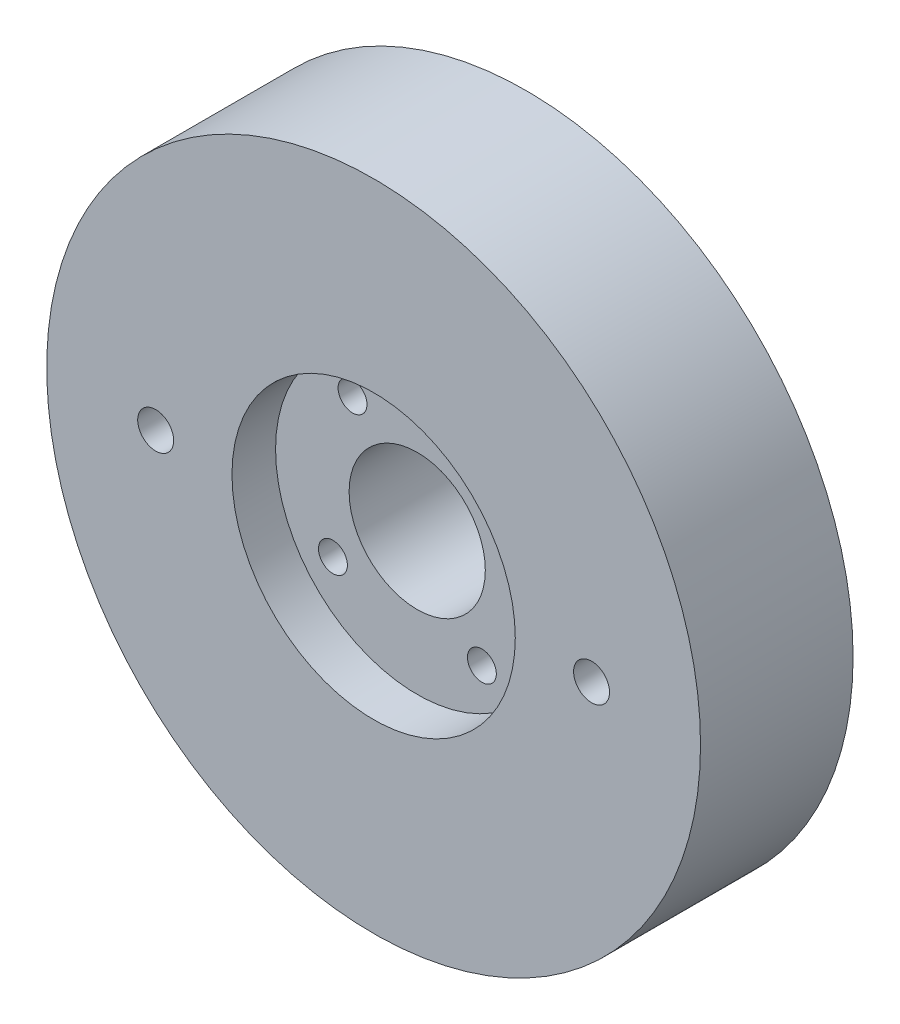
ISO-10303-21;
HEADER;
FILE_DESCRIPTION(('STEP AP214'),'2;1');
FILE_NAME('part.step','',(''),(''),'','','');
FILE_SCHEMA(('AUTOMOTIVE_DESIGN { 1 0 10303 214 1 1 1 1 }'));
ENDSEC;
DATA;
#1=APPLICATION_CONTEXT('core data for automotive mechanical design processes');
#2=APPLICATION_PROTOCOL_DEFINITION('international standard','automotive_design',2000,#1);
#3=PRODUCT_CONTEXT('',#1,'mechanical');
#4=PRODUCT('Part','Part','',(#3));
#5=PRODUCT_RELATED_PRODUCT_CATEGORY('part','',(#4));
#6=PRODUCT_DEFINITION_FORMATION('','',#4);
#7=PRODUCT_DEFINITION_CONTEXT('part definition',#1,'design');
#8=PRODUCT_DEFINITION('design','',#6,#7);
#9=PRODUCT_DEFINITION_SHAPE('','',#8);
#10=(LENGTH_UNIT() NAMED_UNIT(*) SI_UNIT(.MILLI.,.METRE.));
#11=(NAMED_UNIT(*) PLANE_ANGLE_UNIT() SI_UNIT($,.RADIAN.));
#12=(NAMED_UNIT(*) SI_UNIT($,.STERADIAN.) SOLID_ANGLE_UNIT());
#13=UNCERTAINTY_MEASURE_WITH_UNIT(LENGTH_MEASURE(1.E-05),#10,'distance_accuracy_value','');
#14=(GEOMETRIC_REPRESENTATION_CONTEXT(3) GLOBAL_UNCERTAINTY_ASSIGNED_CONTEXT((#13)) GLOBAL_UNIT_ASSIGNED_CONTEXT((#10,
#11,#12)) REPRESENTATION_CONTEXT('',''));
#15=CARTESIAN_POINT('',(0.,0.,0.));
#16=DIRECTION('',(0.,0.,1.));
#17=DIRECTION('',(1.,0.,0.));
#18=AXIS2_PLACEMENT_3D('',#15,#16,#17);
#19=CARTESIAN_POINT('',(-15.4703901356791,-11.87084786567,0.));
#20=DIRECTION('',(0.,0.,-1.));
#21=DIRECTION('',(-1.,0.,0.));
#22=AXIS2_PLACEMENT_3D('',#19,#20,#21);
#23=CYLINDRICAL_SURFACE('',#22,2.64999999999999);
#24=CARTESIAN_POINT('',(-15.4703901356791,-11.87084786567,20.));
#25=DIRECTION('',(0.,0.,1.));
#26=DIRECTION('',(1.,0.,0.));
#27=AXIS2_PLACEMENT_3D('',#24,#25,#26);
#28=CIRCLE('',#27,2.64999999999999);
#29=CARTESIAN_POINT('',(-12.8203901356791,-11.87084786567,20.));
#30=VERTEX_POINT('',#29);
#31=EDGE_CURVE('E101',#30,#30,#28,.T.);
#32=ORIENTED_EDGE('',*,*,#31,.T.);
#33=EDGE_LOOP('',(#32));
#34=FACE_BOUND('',#33,.T.);
#35=CARTESIAN_POINT('',(-15.4703901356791,-11.87084786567,7.5));
#36=DIRECTION('',(0.,0.,-1.));
#37=DIRECTION('',(-1.,0.,0.));
#38=AXIS2_PLACEMENT_3D('',#35,#36,#37);
#39=CIRCLE('',#38,2.64999999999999);
#40=CARTESIAN_POINT('',(-18.1203901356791,-11.87084786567,7.5));
#41=VERTEX_POINT('',#40);
#42=EDGE_CURVE('E124',#41,#41,#39,.F.);
#43=ORIENTED_EDGE('',*,*,#42,.F.);
#44=EDGE_LOOP('',(#43));
#45=FACE_BOUND('',#44,.T.);
#46=ADVANCED_FACE('F46',(#34,#45),#23,.F.);
#47=CARTESIAN_POINT('',(11.8708478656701,-15.4703901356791,0.));
#48=DIRECTION('',(0.,0.,-1.));
#49=DIRECTION('',(-1.,0.,0.));
#50=AXIS2_PLACEMENT_3D('',#47,#48,#49);
#51=CYLINDRICAL_SURFACE('',#50,2.64999999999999);
#52=CARTESIAN_POINT('',(11.8708478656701,-15.4703901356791,20.));
#53=DIRECTION('',(0.,0.,1.));
#54=DIRECTION('',(1.,0.,0.));
#55=AXIS2_PLACEMENT_3D('',#52,#53,#54);
#56=CIRCLE('',#55,2.64999999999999);
#57=CARTESIAN_POINT('',(14.5208478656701,-15.4703901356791,20.));
#58=VERTEX_POINT('',#57);
#59=EDGE_CURVE('E104',#58,#58,#56,.T.);
#60=ORIENTED_EDGE('',*,*,#59,.T.);
#61=EDGE_LOOP('',(#60));
#62=FACE_BOUND('',#61,.T.);
#63=CARTESIAN_POINT('',(11.8708478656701,-15.4703901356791,7.5));
#64=DIRECTION('',(0.,0.,-1.));
#65=DIRECTION('',(-1.,0.,0.));
#66=AXIS2_PLACEMENT_3D('',#63,#64,#65);
#67=CIRCLE('',#66,2.64999999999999);
#68=CARTESIAN_POINT('',(9.22084786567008,-15.4703901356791,7.5));
#69=VERTEX_POINT('',#68);
#70=EDGE_CURVE('E119',#69,#69,#67,.F.);
#71=ORIENTED_EDGE('',*,*,#70,.F.);
#72=EDGE_LOOP('',(#71));
#73=FACE_BOUND('',#72,.T.);
#74=ADVANCED_FACE('F143',(#62,#73),#51,.F.);
#75=CARTESIAN_POINT('',(-11.87084786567,15.4703901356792,0.));
#76=DIRECTION('',(0.,0.,-1.));
#77=DIRECTION('',(-1.,0.,0.));
#78=AXIS2_PLACEMENT_3D('',#75,#76,#77);
#79=CYLINDRICAL_SURFACE('',#78,2.64999999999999);
#80=CARTESIAN_POINT('',(-11.87084786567,15.4703901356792,20.));
#81=DIRECTION('',(0.,0.,1.));
#82=DIRECTION('',(1.,0.,0.));
#83=AXIS2_PLACEMENT_3D('',#80,#81,#82);
#84=CIRCLE('',#83,2.64999999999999);
#85=CARTESIAN_POINT('',(-9.22084786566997,15.4703901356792,20.));
#86=VERTEX_POINT('',#85);
#87=EDGE_CURVE('E98',#86,#86,#84,.T.);
#88=ORIENTED_EDGE('',*,*,#87,.T.);
#89=EDGE_LOOP('',(#88));
#90=FACE_BOUND('',#89,.T.);
#91=CARTESIAN_POINT('',(-11.87084786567,15.4703901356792,7.5));
#92=DIRECTION('',(0.,0.,-1.));
#93=DIRECTION('',(-1.,0.,0.));
#94=AXIS2_PLACEMENT_3D('',#91,#92,#93);
#95=CIRCLE('',#94,2.64999999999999);
#96=CARTESIAN_POINT('',(-14.5208478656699,15.4703901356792,7.5));
#97=VERTEX_POINT('',#96);
#98=EDGE_CURVE('E114',#97,#97,#95,.F.);
#99=ORIENTED_EDGE('',*,*,#98,.F.);
#100=EDGE_LOOP('',(#99));
#101=FACE_BOUND('',#100,.T.);
#102=ADVANCED_FACE('F149',(#90,#101),#79,.F.);
#103=CARTESIAN_POINT('',(15.470390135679,11.8708478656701,0.));
#104=DIRECTION('',(0.,0.,-1.));
#105=DIRECTION('',(-1.,0.,0.));
#106=AXIS2_PLACEMENT_3D('',#103,#104,#105);
#107=CYLINDRICAL_SURFACE('',#106,2.64999999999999);
#108=CARTESIAN_POINT('',(15.470390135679,11.8708478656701,20.));
#109=DIRECTION('',(0.,0.,1.));
#110=DIRECTION('',(1.,0.,0.));
#111=AXIS2_PLACEMENT_3D('',#108,#109,#110);
#112=CIRCLE('',#111,2.64999999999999);
#113=CARTESIAN_POINT('',(18.120390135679,11.8708478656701,20.));
#114=VERTEX_POINT('',#113);
#115=EDGE_CURVE('E107',#114,#114,#112,.T.);
#116=ORIENTED_EDGE('',*,*,#115,.T.);
#117=EDGE_LOOP('',(#116));
#118=FACE_BOUND('',#117,.T.);
#119=CARTESIAN_POINT('',(15.470390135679,11.8708478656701,7.5));
#120=DIRECTION('',(0.,0.,-1.));
#121=DIRECTION('',(-1.,0.,0.));
#122=AXIS2_PLACEMENT_3D('',#119,#120,#121);
#123=CIRCLE('',#122,2.64999999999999);
#124=CARTESIAN_POINT('',(12.820390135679,11.8708478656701,7.5));
#125=VERTEX_POINT('',#124);
#126=EDGE_CURVE('E110',#125,#125,#123,.F.);
#127=ORIENTED_EDGE('',*,*,#126,.F.);
#128=EDGE_LOOP('',(#127));
#129=FACE_BOUND('',#128,.T.);
#130=ADVANCED_FACE('F157',(#118,#129),#107,.F.);
#131=CARTESIAN_POINT('',(0.,0.,0.));
#132=DIRECTION('',(0.,0.,1.));
#133=DIRECTION('',(1.,0.,0.));
#134=AXIS2_PLACEMENT_3D('',#131,#132,#133);
#135=PLANE('',#134);
#136=CARTESIAN_POINT('',(-15.4703901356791,-11.87084786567,0.));
#137=DIRECTION('',(0.,0.,-1.));
#138=DIRECTION('',(-1.,0.,0.));
#139=AXIS2_PLACEMENT_3D('',#136,#137,#138);
#140=CIRCLE('',#139,5.);
#141=CARTESIAN_POINT('',(-20.4703901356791,-11.87084786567,0.));
#142=VERTEX_POINT('',#141);
#143=EDGE_CURVE('E425',#142,#142,#140,.T.);
#144=ORIENTED_EDGE('',*,*,#143,.F.);
#145=EDGE_LOOP('',(#144));
#146=FACE_BOUND('',#145,.T.);
#147=CARTESIAN_POINT('',(11.8708478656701,-15.4703901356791,0.));
#148=DIRECTION('',(0.,0.,-1.));
#149=DIRECTION('',(-1.,0.,0.));
#150=AXIS2_PLACEMENT_3D('',#147,#148,#149);
#151=CIRCLE('',#150,5.);
#152=CARTESIAN_POINT('',(6.87084786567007,-15.4703901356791,0.));
#153=VERTEX_POINT('',#152);
#154=EDGE_CURVE('E126',#153,#153,#151,.T.);
#155=ORIENTED_EDGE('',*,*,#154,.F.);
#156=EDGE_LOOP('',(#155));
#157=FACE_BOUND('',#156,.T.);
#158=CARTESIAN_POINT('',(-11.87084786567,15.4703901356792,0.));
#159=DIRECTION('',(0.,0.,-1.));
#160=DIRECTION('',(-1.,0.,0.));
#161=AXIS2_PLACEMENT_3D('',#158,#159,#160);
#162=CIRCLE('',#161,5.);
#163=CARTESIAN_POINT('',(-16.87084786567,15.4703901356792,0.));
#164=VERTEX_POINT('',#163);
#165=EDGE_CURVE('E122',#164,#164,#162,.T.);
#166=ORIENTED_EDGE('',*,*,#165,.F.);
#167=EDGE_LOOP('',(#166));
#168=FACE_BOUND('',#167,.T.);
#169=CARTESIAN_POINT('',(15.470390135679,11.8708478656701,0.));
#170=DIRECTION('',(0.,0.,-1.));
#171=DIRECTION('',(-1.,0.,0.));
#172=AXIS2_PLACEMENT_3D('',#169,#170,#171);
#173=CIRCLE('',#172,5.);
#174=CARTESIAN_POINT('',(10.470390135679,11.8708478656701,0.));
#175=VERTEX_POINT('',#174);
#176=EDGE_CURVE('E117',#175,#175,#173,.T.);
#177=ORIENTED_EDGE('',*,*,#176,.F.);
#178=EDGE_LOOP('',(#177));
#179=FACE_BOUND('',#178,.T.);
#180=CARTESIAN_POINT('',(0.,0.,0.));
#181=DIRECTION('',(0.,0.,1.));
#182=DIRECTION('',(1.,0.,0.));
#183=AXIS2_PLACEMENT_3D('',#180,#181,#182);
#184=CIRCLE('',#183,60.);
#185=CARTESIAN_POINT('',(60.,0.,0.));
#186=VERTEX_POINT('',#185);
#187=EDGE_CURVE('E90',#186,#186,#184,.T.);
#188=ORIENTED_EDGE('',*,*,#187,.F.);
#189=EDGE_LOOP('',(#188));
#190=FACE_BOUND('',#189,.T.);
#191=CARTESIAN_POINT('',(40.,0.,0.));
#192=DIRECTION('',(0.,0.,1.));
#193=DIRECTION('',(1.,0.,0.));
#194=AXIS2_PLACEMENT_3D('',#191,#192,#193);
#195=CIRCLE('',#194,3.29999999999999);
#196=CARTESIAN_POINT('',(43.3,0.,0.));
#197=VERTEX_POINT('',#196);
#198=EDGE_CURVE('E83',#197,#197,#195,.T.);
#199=ORIENTED_EDGE('',*,*,#198,.T.);
#200=EDGE_LOOP('',(#199));
#201=FACE_BOUND('',#200,.T.);
#202=CARTESIAN_POINT('',(-40.,0.,0.));
#203=DIRECTION('',(0.,0.,1.));
#204=DIRECTION('',(1.,0.,0.));
#205=AXIS2_PLACEMENT_3D('',#202,#203,#204);
#206=CIRCLE('',#205,3.29999999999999);
#207=CARTESIAN_POINT('',(-36.7,0.,0.));
#208=VERTEX_POINT('',#207);
#209=EDGE_CURVE('E70',#208,#208,#206,.T.);
#210=ORIENTED_EDGE('',*,*,#209,.T.);
#211=EDGE_LOOP('',(#210));
#212=FACE_BOUND('',#211,.T.);
#213=CARTESIAN_POINT('',(0.,0.,0.));
#214=DIRECTION('',(0.,0.,-1.));
#215=DIRECTION('',(-1.,0.,0.));
#216=AXIS2_PLACEMENT_3D('',#213,#214,#215);
#217=CIRCLE('',#216,12.5);
#218=CARTESIAN_POINT('',(-12.5,0.,0.));
#219=VERTEX_POINT('',#218);
#220=EDGE_CURVE('E73',#219,#219,#217,.T.);
#221=ORIENTED_EDGE('',*,*,#220,.F.);
#222=EDGE_LOOP('',(#221));
#223=FACE_BOUND('',#222,.T.);
#224=ADVANCED_FACE('F186',(#146,#157,#168,#179,#190,#201,#212,#223),#135,.F.);
#225=CARTESIAN_POINT('',(0.,0.,28.));
#226=DIRECTION('',(0.,0.,-1.));
#227=DIRECTION('',(-1.,0.,0.));
#228=AXIS2_PLACEMENT_3D('',#225,#226,#227);
#229=CYLINDRICAL_SURFACE('',#228,60.);
#230=CARTESIAN_POINT('',(0.,0.,28.));
#231=DIRECTION('',(0.,0.,1.));
#232=DIRECTION('',(1.,0.,0.));
#233=AXIS2_PLACEMENT_3D('',#230,#231,#232);
#234=CIRCLE('',#233,60.);
#235=CARTESIAN_POINT('',(60.,0.,28.));
#236=VERTEX_POINT('',#235);
#237=EDGE_CURVE('E93',#236,#236,#234,.T.);
#238=ORIENTED_EDGE('',*,*,#237,.F.);
#239=EDGE_LOOP('',(#238));
#240=FACE_BOUND('',#239,.T.);
#241=ORIENTED_EDGE('',*,*,#187,.T.);
#242=EDGE_LOOP('',(#241));
#243=FACE_BOUND('',#242,.T.);
#244=ADVANCED_FACE('F184',(#240,#243),#229,.T.);
#245=CARTESIAN_POINT('',(0.,0.,28.));
#246=DIRECTION('',(0.,0.,1.));
#247=DIRECTION('',(1.,0.,0.));
#248=AXIS2_PLACEMENT_3D('',#245,#246,#247);
#249=PLANE('',#248);
#250=CARTESIAN_POINT('',(-40.,0.,28.));
#251=DIRECTION('',(0.,0.,1.));
#252=DIRECTION('',(1.,0.,0.));
#253=AXIS2_PLACEMENT_3D('',#250,#251,#252);
#254=CIRCLE('',#253,3.29999999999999);
#255=CARTESIAN_POINT('',(-36.7,0.,28.));
#256=VERTEX_POINT('',#255);
#257=EDGE_CURVE('E66',#256,#256,#254,.T.);
#258=ORIENTED_EDGE('',*,*,#257,.F.);
#259=EDGE_LOOP('',(#258));
#260=FACE_BOUND('',#259,.T.);
#261=CARTESIAN_POINT('',(40.,0.,28.));
#262=DIRECTION('',(0.,0.,1.));
#263=DIRECTION('',(1.,0.,0.));
#264=AXIS2_PLACEMENT_3D('',#261,#262,#263);
#265=CIRCLE('',#264,3.29999999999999);
#266=CARTESIAN_POINT('',(43.3,0.,28.));
#267=VERTEX_POINT('',#266);
#268=EDGE_CURVE('E80',#267,#267,#265,.T.);
#269=ORIENTED_EDGE('',*,*,#268,.F.);
#270=EDGE_LOOP('',(#269));
#271=FACE_BOUND('',#270,.T.);
#272=CARTESIAN_POINT('',(0.,0.,28.));
#273=DIRECTION('',(0.,0.,1.));
#274=DIRECTION('',(1.,0.,0.));
#275=AXIS2_PLACEMENT_3D('',#272,#273,#274);
#276=CIRCLE('',#275,26.);
#277=CARTESIAN_POINT('',(26.,0.,28.));
#278=VERTEX_POINT('',#277);
#279=EDGE_CURVE('E86',#278,#278,#276,.T.);
#280=ORIENTED_EDGE('',*,*,#279,.F.);
#281=EDGE_LOOP('',(#280));
#282=FACE_BOUND('',#281,.T.);
#283=ORIENTED_EDGE('',*,*,#237,.T.);
#284=EDGE_LOOP('',(#283));
#285=FACE_BOUND('',#284,.T.);
#286=ADVANCED_FACE('F180',(#260,#271,#282,#285),#249,.T.);
#287=CARTESIAN_POINT('',(0.,0.,20.));
#288=DIRECTION('',(0.,0.,1.));
#289=DIRECTION('',(1.,0.,0.));
#290=AXIS2_PLACEMENT_3D('',#287,#288,#289);
#291=CYLINDRICAL_SURFACE('',#290,26.);
#292=CARTESIAN_POINT('',(0.,0.,20.));
#293=DIRECTION('',(0.,0.,1.));
#294=DIRECTION('',(1.,0.,0.));
#295=AXIS2_PLACEMENT_3D('',#292,#293,#294);
#296=CIRCLE('',#295,26.);
#297=CARTESIAN_POINT('',(26.,0.,20.));
#298=VERTEX_POINT('',#297);
#299=EDGE_CURVE('E87',#298,#298,#296,.T.);
#300=ORIENTED_EDGE('',*,*,#299,.F.);
#301=EDGE_LOOP('',(#300));
#302=FACE_BOUND('',#301,.T.);
#303=ORIENTED_EDGE('',*,*,#279,.T.);
#304=EDGE_LOOP('',(#303));
#305=FACE_BOUND('',#304,.T.);
#306=ADVANCED_FACE('F176',(#302,#305),#291,.F.);
#307=CARTESIAN_POINT('',(0.,0.,20.));
#308=DIRECTION('',(0.,0.,1.));
#309=DIRECTION('',(1.,0.,0.));
#310=AXIS2_PLACEMENT_3D('',#307,#308,#309);
#311=PLANE('',#310);
#312=CARTESIAN_POINT('',(19.5,0.,20.));
#313=DIRECTION('',(0.,0.,1.));
#314=DIRECTION('',(1.,0.,0.));
#315=AXIS2_PLACEMENT_3D('',#312,#313,#314);
#316=CIRCLE('',#315,2.50000000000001);
#317=CARTESIAN_POINT('',(22.,0.,20.));
#318=VERTEX_POINT('',#317);
#319=EDGE_CURVE('E13',#318,#318,#316,.F.);
#320=ORIENTED_EDGE('',*,*,#319,.T.);
#321=EDGE_LOOP('',(#320));
#322=FACE_BOUND('',#321,.T.);
#323=ORIENTED_EDGE('',*,*,#115,.F.);
#324=EDGE_LOOP('',(#323));
#325=FACE_BOUND('',#324,.T.);
#326=ORIENTED_EDGE('',*,*,#59,.F.);
#327=EDGE_LOOP('',(#326));
#328=FACE_BOUND('',#327,.T.);
#329=ORIENTED_EDGE('',*,*,#31,.F.);
#330=EDGE_LOOP('',(#329));
#331=FACE_BOUND('',#330,.T.);
#332=ORIENTED_EDGE('',*,*,#87,.F.);
#333=EDGE_LOOP('',(#332));
#334=FACE_BOUND('',#333,.T.);
#335=CARTESIAN_POINT('',(0.,0.,20.));
#336=DIRECTION('',(0.,0.,1.));
#337=DIRECTION('',(1.,0.,0.));
#338=AXIS2_PLACEMENT_3D('',#335,#336,#337);
#339=CIRCLE('',#338,12.5);
#340=CARTESIAN_POINT('',(12.5,0.,20.));
#341=VERTEX_POINT('',#340);
#342=EDGE_CURVE('E67',#341,#341,#339,.T.);
#343=ORIENTED_EDGE('',*,*,#342,.F.);
#344=EDGE_LOOP('',(#343));
#345=FACE_BOUND('',#344,.T.);
#346=ORIENTED_EDGE('',*,*,#299,.T.);
#347=EDGE_LOOP('',(#346));
#348=FACE_BOUND('',#347,.T.);
#349=ADVANCED_FACE('F172',(#322,#325,#328,#331,#334,#345,#348),#311,.T.);
#350=CARTESIAN_POINT('',(40.,0.,28.));
#351=DIRECTION('',(0.,0.,1.));
#352=DIRECTION('',(1.,0.,0.));
#353=AXIS2_PLACEMENT_3D('',#350,#351,#352);
#354=CYLINDRICAL_SURFACE('',#353,3.29999999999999);
#355=ORIENTED_EDGE('',*,*,#198,.F.);
#356=EDGE_LOOP('',(#355));
#357=FACE_BOUND('',#356,.T.);
#358=ORIENTED_EDGE('',*,*,#268,.T.);
#359=EDGE_LOOP('',(#358));
#360=FACE_BOUND('',#359,.T.);
#361=ADVANCED_FACE('F168',(#357,#360),#354,.F.);
#362=CARTESIAN_POINT('',(-40.,0.,28.));
#363=DIRECTION('',(0.,0.,1.));
#364=DIRECTION('',(1.,0.,0.));
#365=AXIS2_PLACEMENT_3D('',#362,#363,#364);
#366=CYLINDRICAL_SURFACE('',#365,3.29999999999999);
#367=ORIENTED_EDGE('',*,*,#209,.F.);
#368=EDGE_LOOP('',(#367));
#369=FACE_BOUND('',#368,.T.);
#370=ORIENTED_EDGE('',*,*,#257,.T.);
#371=EDGE_LOOP('',(#370));
#372=FACE_BOUND('',#371,.T.);
#373=ADVANCED_FACE('F60',(#369,#372),#366,.F.);
#374=CARTESIAN_POINT('',(19.5,0.,10.));
#375=DIRECTION('',(0.,0.,1.));
#376=DIRECTION('',(1.,0.,0.));
#377=AXIS2_PLACEMENT_3D('',#374,#375,#376);
#378=CONICAL_SURFACE('',#377,1.99999999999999,1.02974425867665);
#379=CARTESIAN_POINT('',(19.5,0.,8.79827876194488));
#380=VERTEX_POINT('',#379);
#381=VERTEX_LOOP('',#380);
#382=FACE_BOUND('',#381,.T.);
#383=CARTESIAN_POINT('',(19.5,0.,10.));
#384=DIRECTION('',(0.,0.,1.));
#385=DIRECTION('',(1.,0.,0.));
#386=AXIS2_PLACEMENT_3D('',#383,#384,#385);
#387=CIRCLE('',#386,1.99999999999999);
#388=CARTESIAN_POINT('',(21.5,0.,10.));
#389=VERTEX_POINT('',#388);
#390=EDGE_CURVE('E64',#389,#389,#387,.T.);
#391=ORIENTED_EDGE('',*,*,#390,.T.);
#392=EDGE_LOOP('',(#391));
#393=FACE_BOUND('',#392,.T.);
#394=ADVANCED_FACE('F56',(#382,#393),#378,.F.);
#395=CARTESIAN_POINT('',(19.5,0.,20.));
#396=DIRECTION('',(0.,0.,1.));
#397=DIRECTION('',(1.,0.,0.));
#398=AXIS2_PLACEMENT_3D('',#395,#396,#397);
#399=CYLINDRICAL_SURFACE('',#398,1.99999999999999);
#400=CARTESIAN_POINT('',(19.5,0.,19.5));
#401=DIRECTION('',(0.,0.,1.));
#402=DIRECTION('',(1.,0.,0.));
#403=AXIS2_PLACEMENT_3D('',#400,#401,#402);
#404=CIRCLE('',#403,1.99999999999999);
#405=CARTESIAN_POINT('',(21.5,0.,19.5));
#406=VERTEX_POINT('',#405);
#407=EDGE_CURVE('E53',#406,#406,#404,.T.);
#408=ORIENTED_EDGE('',*,*,#407,.T.);
#409=EDGE_LOOP('',(#408));
#410=FACE_BOUND('',#409,.T.);
#411=ORIENTED_EDGE('',*,*,#390,.F.);
#412=EDGE_LOOP('',(#411));
#413=FACE_BOUND('',#412,.T.);
#414=ADVANCED_FACE('F59',(#410,#413),#399,.F.);
#415=CARTESIAN_POINT('',(0.,0.,28.));
#416=DIRECTION('',(0.,0.,-1.));
#417=DIRECTION('',(-1.,0.,0.));
#418=AXIS2_PLACEMENT_3D('',#415,#416,#417);
#419=CYLINDRICAL_SURFACE('',#418,12.5);
#420=ORIENTED_EDGE('',*,*,#342,.T.);
#421=EDGE_LOOP('',(#420));
#422=FACE_BOUND('',#421,.T.);
#423=ORIENTED_EDGE('',*,*,#220,.T.);
#424=EDGE_LOOP('',(#423));
#425=FACE_BOUND('',#424,.T.);
#426=ADVANCED_FACE('F159',(#422,#425),#419,.F.);
#427=CARTESIAN_POINT('',(15.470390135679,11.8708478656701,7.5));
#428=DIRECTION('',(0.,0.,-1.));
#429=DIRECTION('',(-1.,0.,0.));
#430=AXIS2_PLACEMENT_3D('',#427,#428,#429);
#431=PLANE('',#430);
#432=CARTESIAN_POINT('',(15.470390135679,11.8708478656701,7.5));
#433=DIRECTION('',(0.,0.,-1.));
#434=DIRECTION('',(-1.,0.,0.));
#435=AXIS2_PLACEMENT_3D('',#432,#433,#434);
#436=CIRCLE('',#435,5.);
#437=CARTESIAN_POINT('',(10.470390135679,11.8708478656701,7.5));
#438=VERTEX_POINT('',#437);
#439=EDGE_CURVE('E113',#438,#438,#436,.T.);
#440=ORIENTED_EDGE('',*,*,#439,.T.);
#441=EDGE_LOOP('',(#440));
#442=FACE_BOUND('',#441,.T.);
#443=ORIENTED_EDGE('',*,*,#126,.T.);
#444=EDGE_LOOP('',(#443));
#445=FACE_BOUND('',#444,.T.);
#446=ADVANCED_FACE('F162',(#442,#445),#431,.T.);
#447=CARTESIAN_POINT('',(15.470390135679,11.8708478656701,7.5));
#448=DIRECTION('',(0.,0.,-1.));
#449=DIRECTION('',(-1.,0.,0.));
#450=AXIS2_PLACEMENT_3D('',#447,#448,#449);
#451=CYLINDRICAL_SURFACE('',#450,5.);
#452=ORIENTED_EDGE('',*,*,#439,.F.);
#453=EDGE_LOOP('',(#452));
#454=FACE_BOUND('',#453,.T.);
#455=ORIENTED_EDGE('',*,*,#176,.T.);
#456=EDGE_LOOP('',(#455));
#457=FACE_BOUND('',#456,.T.);
#458=ADVANCED_FACE('F257',(#454,#457),#451,.F.);
#459=CARTESIAN_POINT('',(-11.87084786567,15.4703901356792,7.5));
#460=DIRECTION('',(0.,0.,-1.));
#461=DIRECTION('',(-1.,0.,0.));
#462=AXIS2_PLACEMENT_3D('',#459,#460,#461);
#463=PLANE('',#462);
#464=CARTESIAN_POINT('',(-11.87084786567,15.4703901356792,7.5));
#465=DIRECTION('',(0.,0.,-1.));
#466=DIRECTION('',(-1.,0.,0.));
#467=AXIS2_PLACEMENT_3D('',#464,#465,#466);
#468=CIRCLE('',#467,5.);
#469=CARTESIAN_POINT('',(-16.87084786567,15.4703901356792,7.5));
#470=VERTEX_POINT('',#469);
#471=EDGE_CURVE('E118',#470,#470,#468,.T.);
#472=ORIENTED_EDGE('',*,*,#471,.T.);
#473=EDGE_LOOP('',(#472));
#474=FACE_BOUND('',#473,.T.);
#475=ORIENTED_EDGE('',*,*,#98,.T.);
#476=EDGE_LOOP('',(#475));
#477=FACE_BOUND('',#476,.T.);
#478=ADVANCED_FACE('F266',(#474,#477),#463,.T.);
#479=CARTESIAN_POINT('',(-11.87084786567,15.4703901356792,7.5));
#480=DIRECTION('',(0.,0.,-1.));
#481=DIRECTION('',(-1.,0.,0.));
#482=AXIS2_PLACEMENT_3D('',#479,#480,#481);
#483=CYLINDRICAL_SURFACE('',#482,5.);
#484=ORIENTED_EDGE('',*,*,#471,.F.);
#485=EDGE_LOOP('',(#484));
#486=FACE_BOUND('',#485,.T.);
#487=ORIENTED_EDGE('',*,*,#165,.T.);
#488=EDGE_LOOP('',(#487));
#489=FACE_BOUND('',#488,.T.);
#490=ADVANCED_FACE('F274',(#486,#489),#483,.F.);
#491=CARTESIAN_POINT('',(11.8708478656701,-15.4703901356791,7.5));
#492=DIRECTION('',(0.,0.,-1.));
#493=DIRECTION('',(-1.,0.,0.));
#494=AXIS2_PLACEMENT_3D('',#491,#492,#493);
#495=PLANE('',#494);
#496=CARTESIAN_POINT('',(11.8708478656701,-15.4703901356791,7.5));
#497=DIRECTION('',(0.,0.,-1.));
#498=DIRECTION('',(-1.,0.,0.));
#499=AXIS2_PLACEMENT_3D('',#496,#497,#498);
#500=CIRCLE('',#499,5.);
#501=CARTESIAN_POINT('',(6.87084786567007,-15.4703901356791,7.5));
#502=VERTEX_POINT('',#501);
#503=EDGE_CURVE('E123',#502,#502,#500,.T.);
#504=ORIENTED_EDGE('',*,*,#503,.T.);
#505=EDGE_LOOP('',(#504));
#506=FACE_BOUND('',#505,.T.);
#507=ORIENTED_EDGE('',*,*,#70,.T.);
#508=EDGE_LOOP('',(#507));
#509=FACE_BOUND('',#508,.T.);
#510=ADVANCED_FACE('F282',(#506,#509),#495,.T.);
#511=CARTESIAN_POINT('',(11.8708478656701,-15.4703901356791,7.5));
#512=DIRECTION('',(0.,0.,-1.));
#513=DIRECTION('',(-1.,0.,0.));
#514=AXIS2_PLACEMENT_3D('',#511,#512,#513);
#515=CYLINDRICAL_SURFACE('',#514,5.);
#516=ORIENTED_EDGE('',*,*,#503,.F.);
#517=EDGE_LOOP('',(#516));
#518=FACE_BOUND('',#517,.T.);
#519=ORIENTED_EDGE('',*,*,#154,.T.);
#520=EDGE_LOOP('',(#519));
#521=FACE_BOUND('',#520,.T.);
#522=ADVANCED_FACE('F290',(#518,#521),#515,.F.);
#523=CARTESIAN_POINT('',(-15.4703901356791,-11.87084786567,7.5));
#524=DIRECTION('',(0.,0.,-1.));
#525=DIRECTION('',(-1.,0.,0.));
#526=AXIS2_PLACEMENT_3D('',#523,#524,#525);
#527=PLANE('',#526);
#528=CARTESIAN_POINT('',(-15.4703901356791,-11.87084786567,7.5));
#529=DIRECTION('',(0.,0.,-1.));
#530=DIRECTION('',(-1.,0.,0.));
#531=AXIS2_PLACEMENT_3D('',#528,#529,#530);
#532=CIRCLE('',#531,5.);
#533=CARTESIAN_POINT('',(-20.4703901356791,-11.87084786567,7.5));
#534=VERTEX_POINT('',#533);
#535=EDGE_CURVE('E127',#534,#534,#532,.T.);
#536=ORIENTED_EDGE('',*,*,#535,.T.);
#537=EDGE_LOOP('',(#536));
#538=FACE_BOUND('',#537,.T.);
#539=ORIENTED_EDGE('',*,*,#42,.T.);
#540=EDGE_LOOP('',(#539));
#541=FACE_BOUND('',#540,.T.);
#542=ADVANCED_FACE('F138',(#538,#541),#527,.T.);
#543=CARTESIAN_POINT('',(-15.4703901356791,-11.87084786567,7.5));
#544=DIRECTION('',(0.,0.,-1.));
#545=DIRECTION('',(-1.,0.,0.));
#546=AXIS2_PLACEMENT_3D('',#543,#544,#545);
#547=CYLINDRICAL_SURFACE('',#546,5.);
#548=ORIENTED_EDGE('',*,*,#535,.F.);
#549=EDGE_LOOP('',(#548));
#550=FACE_BOUND('',#549,.T.);
#551=ORIENTED_EDGE('',*,*,#143,.T.);
#552=EDGE_LOOP('',(#551));
#553=FACE_BOUND('',#552,.T.);
#554=ADVANCED_FACE('F133',(#550,#553),#547,.F.);
#555=CARTESIAN_POINT('',(19.5,0.,19.5));
#556=DIRECTION('',(0.,0.,1.));
#557=DIRECTION('',(1.,0.,0.));
#558=AXIS2_PLACEMENT_3D('',#555,#556,#557);
#559=CONICAL_SURFACE('',#558,1.99999999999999,0.78539816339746);
#560=ORIENTED_EDGE('',*,*,#319,.F.);
#561=EDGE_LOOP('',(#560));
#562=FACE_BOUND('',#561,.T.);
#563=ORIENTED_EDGE('',*,*,#407,.F.);
#564=EDGE_LOOP('',(#563));
#565=FACE_BOUND('',#564,.T.);
#566=ADVANCED_FACE('F48',(#562,#565),#559,.F.);
#567=CLOSED_SHELL('',(#46,#74,#102,#130,#224,#244,#286,#306,#349,#361,#373,#394,#414,#426,#446,
#458,#478,#490,#510,#522,#542,#554,#566));
#568=MANIFOLD_SOLID_BREP('B2',#567);
#569=ADVANCED_BREP_SHAPE_REPRESENTATION('',(#18,#568),#14);
#570=SHAPE_DEFINITION_REPRESENTATION(#9,#569);
ENDSEC;
END-ISO-10303-21;
